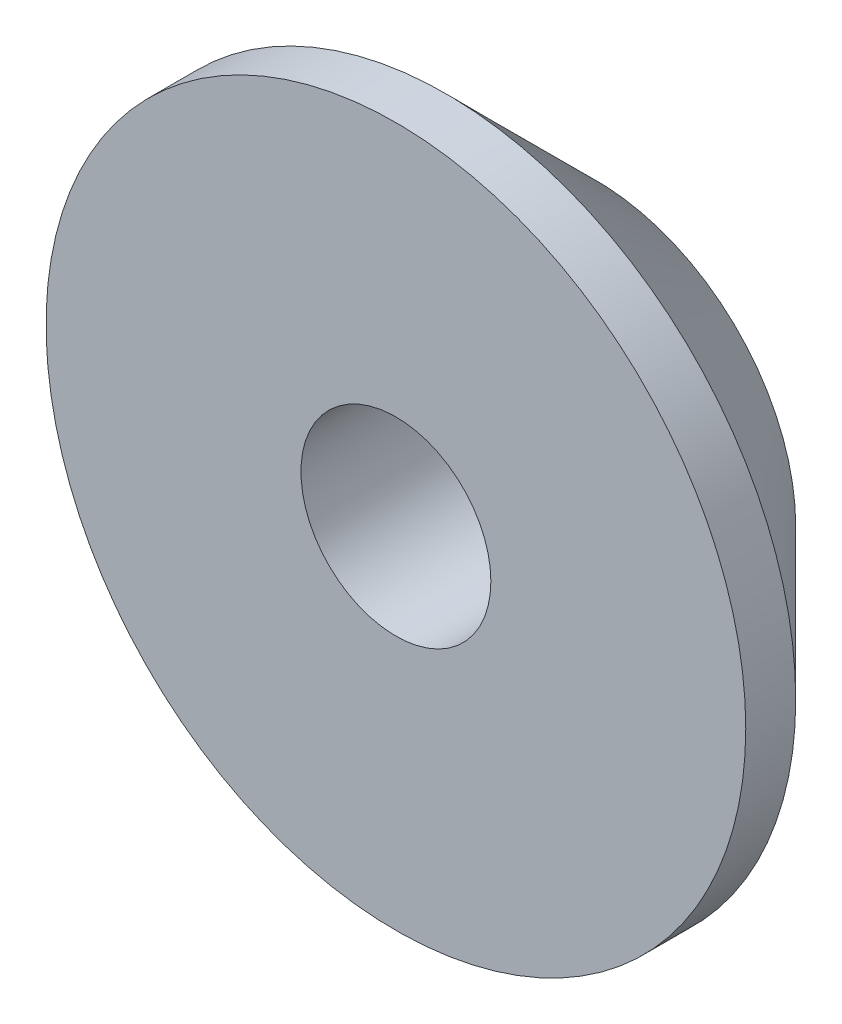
ISO-10303-21;
HEADER;
FILE_DESCRIPTION(('STEP AP214'),'2;1');
FILE_NAME('part.step','',(''),(''),'','','');
FILE_SCHEMA(('AUTOMOTIVE_DESIGN { 1 0 10303 214 1 1 1 1 }'));
ENDSEC;
DATA;
#1=APPLICATION_CONTEXT('core data for automotive mechanical design processes');
#2=APPLICATION_PROTOCOL_DEFINITION('international standard','automotive_design',2000,#1);
#3=PRODUCT_CONTEXT('',#1,'mechanical');
#4=PRODUCT('Part','Part','',(#3));
#5=PRODUCT_RELATED_PRODUCT_CATEGORY('part','',(#4));
#6=PRODUCT_DEFINITION_FORMATION('','',#4);
#7=PRODUCT_DEFINITION_CONTEXT('part definition',#1,'design');
#8=PRODUCT_DEFINITION('design','',#6,#7);
#9=PRODUCT_DEFINITION_SHAPE('','',#8);
#10=(LENGTH_UNIT() NAMED_UNIT(*) SI_UNIT(.MILLI.,.METRE.));
#11=(NAMED_UNIT(*) PLANE_ANGLE_UNIT() SI_UNIT($,.RADIAN.));
#12=(NAMED_UNIT(*) SI_UNIT($,.STERADIAN.) SOLID_ANGLE_UNIT());
#13=UNCERTAINTY_MEASURE_WITH_UNIT(LENGTH_MEASURE(1.E-05),#10,'distance_accuracy_value','');
#14=(GEOMETRIC_REPRESENTATION_CONTEXT(3) GLOBAL_UNCERTAINTY_ASSIGNED_CONTEXT((#13)) GLOBAL_UNIT_ASSIGNED_CONTEXT((#10,
#11,#12)) REPRESENTATION_CONTEXT('',''));
#15=CARTESIAN_POINT('',(0.,0.,0.));
#16=DIRECTION('',(0.,0.,1.));
#17=DIRECTION('',(1.,0.,0.));
#18=AXIS2_PLACEMENT_3D('',#15,#16,#17);
#19=CARTESIAN_POINT('',(0.,0.,2.));
#20=DIRECTION('',(0.,0.,1.));
#21=DIRECTION('',(1.,0.,0.));
#22=AXIS2_PLACEMENT_3D('',#19,#20,#21);
#23=PLANE('',#22);
#24=CARTESIAN_POINT('',(0.,0.,2.));
#25=DIRECTION('',(0.,0.,1.));
#26=DIRECTION('',(1.,0.,0.));
#27=AXIS2_PLACEMENT_3D('',#24,#25,#26);
#28=CIRCLE('',#27,3.5);
#29=CARTESIAN_POINT('',(3.5,0.,2.));
#30=VERTEX_POINT('',#29);
#31=EDGE_CURVE('E25',#30,#30,#28,.T.);
#32=ORIENTED_EDGE('',*,*,#31,.T.);
#33=EDGE_LOOP('',(#32));
#34=FACE_BOUND('',#33,.T.);
#35=CARTESIAN_POINT('',(0.,0.,2.));
#36=DIRECTION('',(0.,0.,1.));
#37=DIRECTION('',(1.,0.,0.));
#38=AXIS2_PLACEMENT_3D('',#35,#36,#37);
#39=CIRCLE('',#38,0.95);
#40=CARTESIAN_POINT('',(0.95,0.,2.));
#41=VERTEX_POINT('',#40);
#42=EDGE_CURVE('E29',#41,#41,#39,.T.);
#43=ORIENTED_EDGE('',*,*,#42,.F.);
#44=EDGE_LOOP('',(#43));
#45=FACE_BOUND('',#44,.T.);
#46=ADVANCED_FACE('F14',(#34,#45),#23,.T.);
#47=CARTESIAN_POINT('',(0.,0.,0.));
#48=DIRECTION('',(0.,0.,1.));
#49=DIRECTION('',(1.,0.,0.));
#50=AXIS2_PLACEMENT_3D('',#47,#48,#49);
#51=PLANE('',#50);
#52=CARTESIAN_POINT('',(0.,0.,0.));
#53=DIRECTION('',(0.,0.,1.));
#54=DIRECTION('',(1.,0.,0.));
#55=AXIS2_PLACEMENT_3D('',#52,#53,#54);
#56=CIRCLE('',#55,2.);
#57=CARTESIAN_POINT('',(2.,0.,0.));
#58=VERTEX_POINT('',#57);
#59=EDGE_CURVE('E10',#58,#58,#56,.F.);
#60=ORIENTED_EDGE('',*,*,#59,.T.);
#61=EDGE_LOOP('',(#60));
#62=FACE_BOUND('',#61,.T.);
#63=CARTESIAN_POINT('',(0.,0.,0.));
#64=DIRECTION('',(0.,0.,1.));
#65=DIRECTION('',(1.,0.,0.));
#66=AXIS2_PLACEMENT_3D('',#63,#64,#65);
#67=CIRCLE('',#66,0.95);
#68=CARTESIAN_POINT('',(0.95,0.,0.));
#69=VERTEX_POINT('',#68);
#70=EDGE_CURVE('E34',#69,#69,#67,.T.);
#71=ORIENTED_EDGE('',*,*,#70,.T.);
#72=EDGE_LOOP('',(#71));
#73=FACE_BOUND('',#72,.T.);
#74=ADVANCED_FACE('F38',(#62,#73),#51,.F.);
#75=CARTESIAN_POINT('',(0.,0.,2.));
#76=DIRECTION('',(0.,0.,-1.));
#77=DIRECTION('',(-1.,0.,0.));
#78=AXIS2_PLACEMENT_3D('',#75,#76,#77);
#79=CYLINDRICAL_SURFACE('',#78,3.5);
#80=CARTESIAN_POINT('',(0.,0.,1.5));
#81=DIRECTION('',(0.,0.,1.));
#82=DIRECTION('',(1.,0.,0.));
#83=AXIS2_PLACEMENT_3D('',#80,#81,#82);
#84=CIRCLE('',#83,3.5);
#85=CARTESIAN_POINT('',(3.5,0.,1.5));
#86=VERTEX_POINT('',#85);
#87=EDGE_CURVE('E21',#86,#86,#84,.T.);
#88=ORIENTED_EDGE('',*,*,#87,.T.);
#89=EDGE_LOOP('',(#88));
#90=FACE_BOUND('',#89,.T.);
#91=ORIENTED_EDGE('',*,*,#31,.F.);
#92=EDGE_LOOP('',(#91));
#93=FACE_BOUND('',#92,.T.);
#94=ADVANCED_FACE('F16',(#90,#93),#79,.T.);
#95=CARTESIAN_POINT('',(0.,0.,2.));
#96=DIRECTION('',(0.,0.,-1.));
#97=DIRECTION('',(-1.,0.,0.));
#98=AXIS2_PLACEMENT_3D('',#95,#96,#97);
#99=CYLINDRICAL_SURFACE('',#98,0.95);
#100=ORIENTED_EDGE('',*,*,#42,.T.);
#101=EDGE_LOOP('',(#100));
#102=FACE_BOUND('',#101,.T.);
#103=ORIENTED_EDGE('',*,*,#70,.F.);
#104=EDGE_LOOP('',(#103));
#105=FACE_BOUND('',#104,.T.);
#106=ADVANCED_FACE('F40',(#102,#105),#99,.F.);
#107=CARTESIAN_POINT('',(0.,0.,1.5));
#108=DIRECTION('',(0.,0.,1.));
#109=DIRECTION('',(1.,0.,0.));
#110=AXIS2_PLACEMENT_3D('',#107,#108,#109);
#111=CONICAL_SURFACE('',#110,3.5,0.785398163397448);
#112=ORIENTED_EDGE('',*,*,#59,.F.);
#113=EDGE_LOOP('',(#112));
#114=FACE_BOUND('',#113,.T.);
#115=ORIENTED_EDGE('',*,*,#87,.F.);
#116=EDGE_LOOP('',(#115));
#117=FACE_BOUND('',#116,.T.);
#118=ADVANCED_FACE('F42',(#114,#117),#111,.T.);
#119=CLOSED_SHELL('',(#46,#74,#94,#106,#118));
#120=MANIFOLD_SOLID_BREP('B1',#119);
#121=ADVANCED_BREP_SHAPE_REPRESENTATION('',(#18,#120),#14);
#122=SHAPE_DEFINITION_REPRESENTATION(#9,#121);
ENDSEC;
END-ISO-10303-21;
